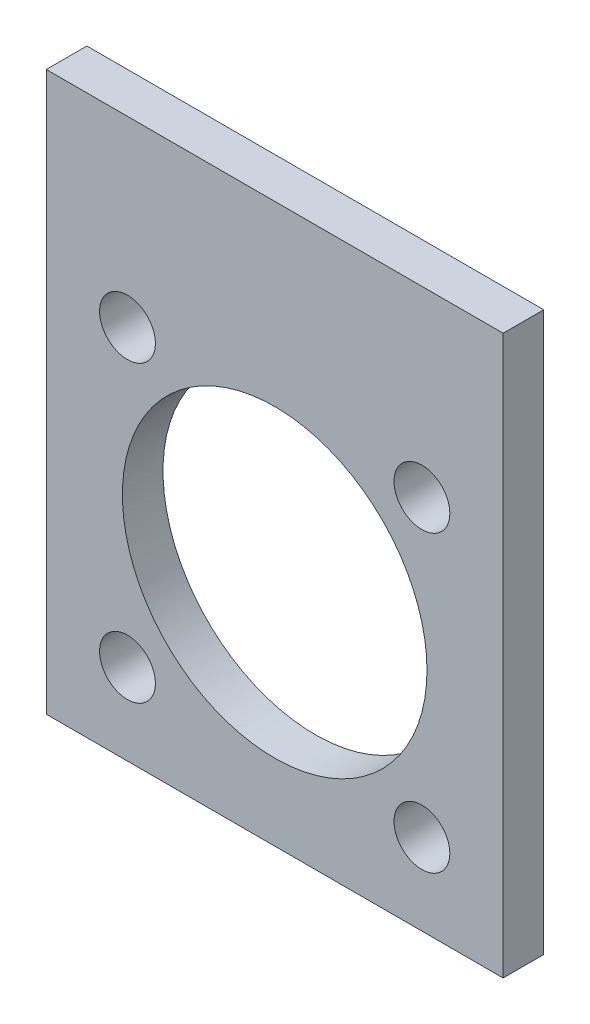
from build123d import *

# Parameters (mm, degrees)
SKETCH_1_W      = 90
SKETCH_1_H      = 110
SKETCH_1_R      = 30
SKETCH_1_R_2    = 5.5
EXTRUDE_1_DEPTH = 8


with BuildPart() as part:
    # Sketch 1 → Extrude 1 (new body)
    with BuildSketch(Plane.XY):
        with Locations((0, 10)):
            Rectangle(SKETCH_1_W, SKETCH_1_H)
        Circle(SKETCH_1_R, mode=Mode.SUBTRACT)
        with Locations((-29, 29)):
            Circle(SKETCH_1_R_2, mode=Mode.SUBTRACT)
        with Locations((29, 29)):
            Circle(SKETCH_1_R_2, mode=Mode.SUBTRACT)
        with Locations((-29, -29)):
            Circle(SKETCH_1_R_2, mode=Mode.SUBTRACT)
        with Locations((29, -29)):
            Circle(SKETCH_1_R_2, mode=Mode.SUBTRACT)
    extrude(amount=EXTRUDE_1_DEPTH)


solid = part.part
